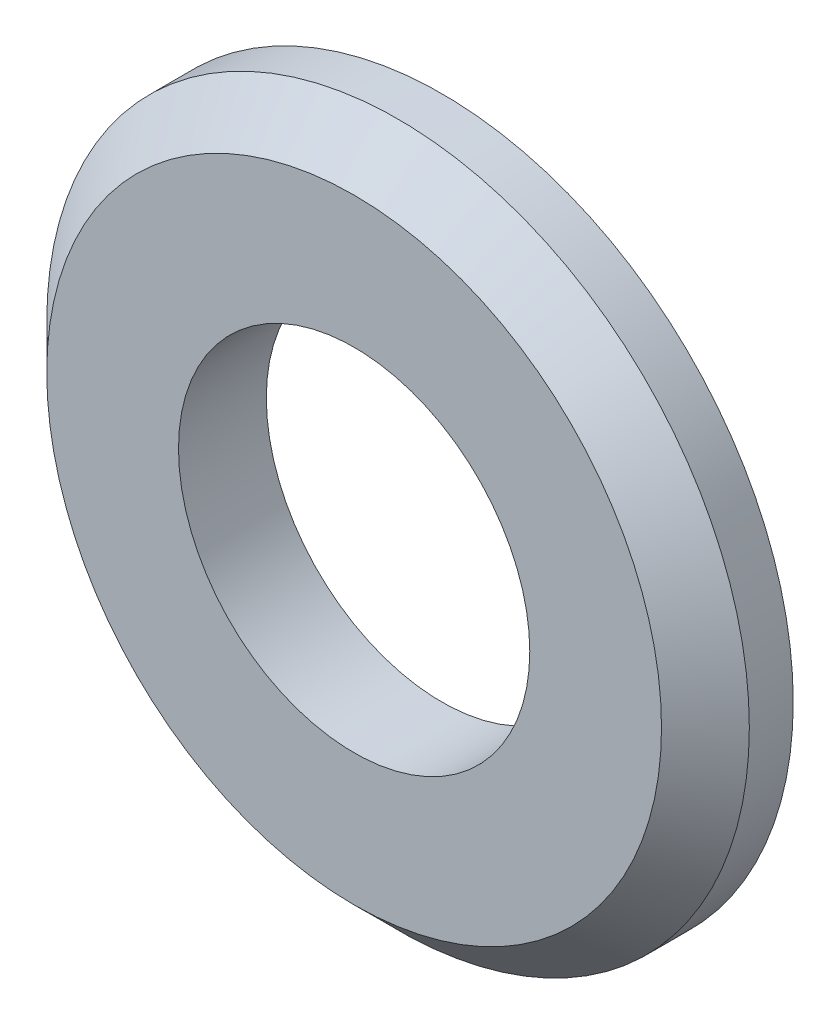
from build123d import *

# Parameters (mm, degrees)
ESQUISSE2_R        = 4
ESQUISSE2_R_2      = 2
BOSS_EXTRU_1_DEPTH = 1
CHANFREIN1_SIZE    = 0.5


with BuildPart() as part:
    # Esquisse2 → Boss.-Extru.1 (new body)
    with BuildSketch(Plane.XY):
        Circle(ESQUISSE2_R)
        Circle(ESQUISSE2_R_2, mode=Mode.SUBTRACT)
    extrude(amount=BOSS_EXTRU_1_DEPTH)

    # Chanfrein1
    chanfrein1_edges = [part.edges().sort_by_distance(p)[0] for p in [
        (-4, 0, 1),
    ]]
    chamfer(chanfrein1_edges, length=CHANFREIN1_SIZE)


solid = part.part
